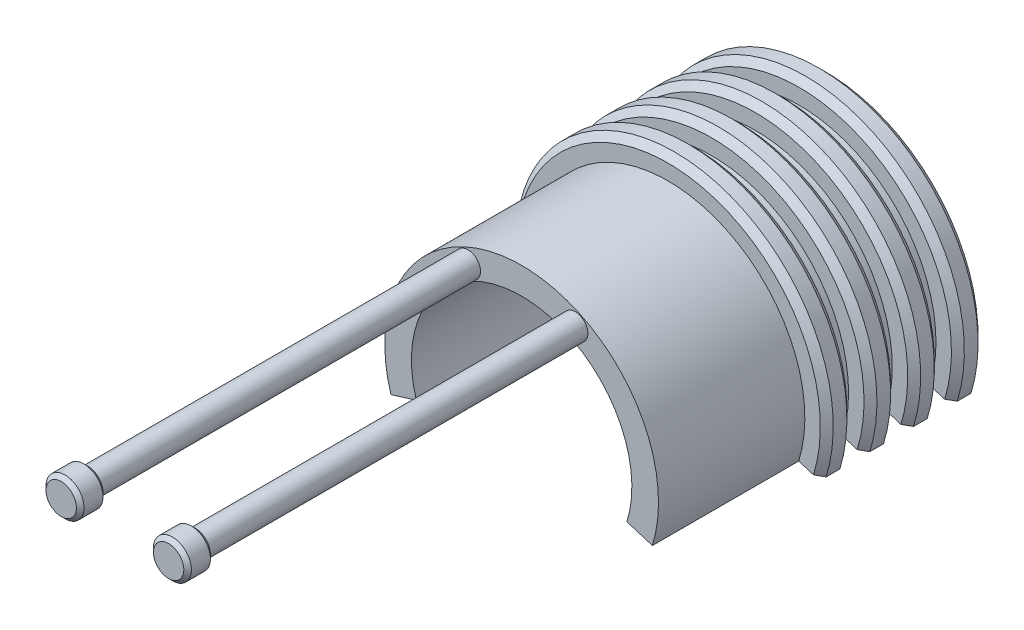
from build123d import *

# Parameters (mm, degrees)
BOSS_EXTRUDE1_DEPTH        = 80
SKETCH2_R                  = 1.876677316
BOSS_EXTRUDE2_DEPTH        = 100
SKETCH3_R                  = 3.3
BOSS_EXTRUDE3_DEPTH        = 100
CUT_EXTRUDE1_START         = -100
SKETCH4_R                  = 1.876677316
CUT_EXTRUDE1_DEPTH         = 100
BOSS_EXTRUDE4_DEPTH        = 7
CHAMFER1_SIZE              = 1.7
LPATTERN1_COUNT            = 4
LPATTERN1_PITCH            = 11.5
CHAMFER1_OF_LPATTERN1_SIZE = 1.7
SKETCH6_R                  = 5
BOSS_EXTRUDE5_DEPTH        = 7
CHAMFER2_SIZE              = 1
CHAMFER3_SIZE              = 1


with BuildPart() as part:
    # Sketch1 → Boss-Extrude1 (new body)
    with BuildSketch(Plane.XY):
        with BuildLine():
            Line((-27.702041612, -8.57886301), (-34.388741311, -10.649623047))
            ThreePointArc((-34.388741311, -10.649623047), (0, 36), (34.388741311, -10.649623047))
            Line((34.388741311, -10.649623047), (27.702041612, -8.57886301))
            ThreePointArc((27.702041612, -8.57886301), (0, 29), (-27.702041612, -8.57886301))
        make_face()
    extrude(amount=BOSS_EXTRUDE1_DEPTH)

    # Sketch2 → Boss-Extrude2 (add)
    with BuildSketch(Plane.XY.offset(80)):
        with Locations((25.376889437, 20.193968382)):
            Circle(SKETCH2_R)
    extrude(amount=BOSS_EXTRUDE2_DEPTH)

    # Sketch3 → Boss-Extrude3 (add)
    with BuildSketch(Plane.XY.offset(80)):
        with Locations((14.127536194, 29.192389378)):
            Circle(SKETCH3_R)
        with Locations((-14.127536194, 29.192389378)):
            Circle(SKETCH3_R)
    extrude(amount=BOSS_EXTRUDE3_DEPTH)

    # Sketch4 → Cut-Extrude1 (cut)
    with BuildSketch(Plane.XY.offset(180).offset(CUT_EXTRUDE1_START)):
        with Locations((25.376889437, 20.193968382)):
            Circle(SKETCH4_R)
    extrude(amount=CUT_EXTRUDE1_DEPTH, mode=Mode.SUBTRACT)

    # Sketch5 → Boss-Extrude4 (add)
    with BuildSketch(Plane(origin=(0, 0, 0), x_dir=(-1, 0, 0), z_dir=(0, 0, -1))):
        with BuildLine():
            Line((-34.388741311, -10.649623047), (-39.896642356, -12.355328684))
            ThreePointArc((-39.896642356, -12.355328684), (0, 41.765969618), (39.896642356, -12.355328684))
            Line((39.896642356, -12.355328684), (34.388741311, -10.649623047))
            ThreePointArc((34.388741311, -10.649623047), (0, 36), (-34.388741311, -10.649623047))
        make_face()
    boss_extrude4 = extrude(amount=-BOSS_EXTRUDE4_DEPTH)

    # Chamfer1
    chamfer1_edges = [part.edges().sort_by_distance(p)[0] for p in [
        (0, 41.765969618, 7),
        (0, 41.765969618, 0),
    ]]
    chamfer(chamfer1_edges, length=CHAMFER1_SIZE)

    # LPattern1: Boss-Extrude4 ×4
    with Locations(*[(0, 0, i * LPATTERN1_PITCH) for i in range(1, LPATTERN1_COUNT)]):
        add(boss_extrude4)

    # Chamfer1 of LPattern1
    chamfer1_of_lpattern1_edges = [part.edges().sort_by_distance(p)[0] for p in [
        (0, 41.765969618, 18.5),
        (0, 41.765969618, 11.5),
        (0, 41.765969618, 30),
        (0, 41.765969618, 23),
        (0, 41.765969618, 41.5),
        (0, 41.765969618, 34.5),
    ]]
    chamfer(chamfer1_of_lpattern1_edges, length=CHAMFER1_OF_LPATTERN1_SIZE)

    # Sketch6 → Boss-Extrude5 (add)
    with BuildSketch(Plane.XY.offset(180)):
        with Locations((-14.127536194, 29.192389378)):
            Circle(SKETCH6_R)
        with Locations((14.127536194, 29.192389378)):
            Circle(SKETCH6_R)
    extrude(amount=BOSS_EXTRUDE5_DEPTH)

    # Chamfer2
    chamfer2_edges = [part.edges().sort_by_distance(p)[0] for p in [
        (-19.127536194, 29.192389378, 187),
        (9.127536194, 29.192389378, 180),
        (9.127536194, 29.192389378, 187),
    ]]
    chamfer(chamfer2_edges, length=CHAMFER2_SIZE)

    # Chamfer3
    chamfer3_edges = [part.edges().sort_by_distance(p)[0] for p in [
        (-19.127536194, 29.192389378, 180),
    ]]
    chamfer(chamfer3_edges, length=CHAMFER3_SIZE)


solid = part.part
